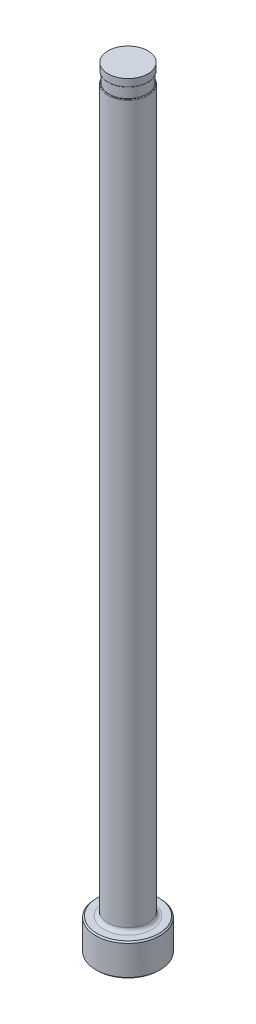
from build123d import *

# Parameters (mm, degrees)
CHAMFER1_SIZE     = 0.254
FILLET1_R         = 0.762
SKETCH2_W         = 0.2032
SKETCH2_H         = 2.032
D_SLOT_DEPTH      = 153.664354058
D_SLOT_DEPTH_BACK = 153.664354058
SKETCH5_W         = 0.0254
SKETCH5_H         = 1.524
FILLET2_R         = 0.127


with BuildPart() as part:
    # Sketch1 → Revolve1 (revolve)
    with BuildSketch(Plane.XY, mode=Mode.PRIVATE) as revolve1_sk:
        Polygon((0, 0), (-6.35, 0), (-6.35, 6.35), (-3.96875, 6.35), (-3.96875, 152.4), (0, 152.4), align=None)
    revolve(revolve1_sk.sketch.rotate(Axis((0, 259.958771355, 0), (0, -1, 0)), 270), axis=Axis((0, 259.958771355, 0), (0, -1, 0)))

    # Chamfer1
    chamfer1_edges = [part.edges().sort_by_distance(p)[0] for p in [
        (0, 6.35, -6.35),
        (0, 0, -6.35),
    ]]
    chamfer(chamfer1_edges, length=CHAMFER1_SIZE)

    # Fillet1
    fillet1_edges = [part.edges().sort_by_distance(p)[0] for p in [
        (0, 6.35, -3.96875),
    ]]
    fillet(fillet1_edges, radius=FILLET1_R)

    # Sketch2 → Vent Relief (revolve, cut)
    with BuildSketch(Plane.XY, mode=Mode.PRIVATE) as vent_relief_sk:
        with Locations((-3.86715, 149.86)):
            Rectangle(SKETCH2_W, SKETCH2_H)
    revolve(vent_relief_sk.sketch.rotate(Axis((0, 153.448281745, 0), (0, -1, 0)), 270), axis=Axis((0, 153.448281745, 0), (0, -1, 0)), mode=Mode.SUBTRACT)

    # Sketch3 → D-Slot (cut, two sides: drawn at the far end of the back side and taken through both)
    with BuildSketch(Plane.XY.offset(-D_SLOT_DEPTH_BACK)):
        with BuildLine():
            Line((-3.76555, 149.86), (-3.76555, 86.36))
            ThreePointArc((-3.76555, 86.36), (-3.816763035, 85.792038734), (-3.96875, 85.2424))
            Line((-3.96875, 85.2424), (-3.96875, 149.86))
            Line((-3.96875, 149.86), (-3.76555, 149.86))
        make_face()
    extrude(amount=D_SLOT_DEPTH + D_SLOT_DEPTH_BACK, mode=Mode.SUBTRACT)

    # Sketch5 → Vent Diameter (revolve, cut)
    with BuildSketch(Plane.XY, mode=Mode.PRIVATE) as vent_diameter_sk:
        with Locations((-3.95605, 151.638)):
            Rectangle(SKETCH5_W, SKETCH5_H)
    revolve(vent_diameter_sk.sketch.rotate(Axis((0, 152.687735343, 0), (0, -1, 0)), 90), axis=Axis((0, 152.687735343, 0), (0, -1, 0)), mode=Mode.SUBTRACT)

    # Fillet2
    fillet2_edges = [part.edges().sort_by_distance(p)[0] for p in [
        (3.219188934, 148.844, -2.321163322),
        (0, 150.876, 3.94335),
    ]]
    fillet(fillet2_edges, radius=FILLET2_R)


solid = part.part
